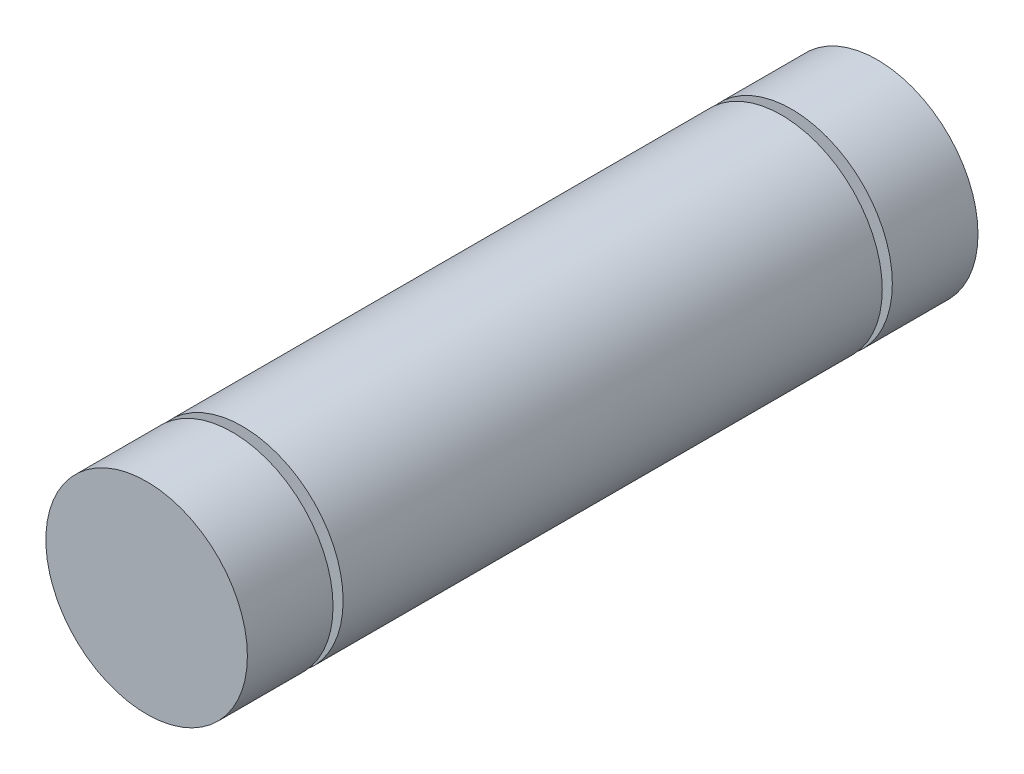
ISO-10303-21;
HEADER;
FILE_DESCRIPTION(('STEP AP214'),'2;1');
FILE_NAME('part.step','',(''),(''),'','','');
FILE_SCHEMA(('AUTOMOTIVE_DESIGN { 1 0 10303 214 1 1 1 1 }'));
ENDSEC;
DATA;
#1=APPLICATION_CONTEXT('core data for automotive mechanical design processes');
#2=APPLICATION_PROTOCOL_DEFINITION('international standard','automotive_design',2000,#1);
#3=PRODUCT_CONTEXT('',#1,'mechanical');
#4=PRODUCT('Part','Part','',(#3));
#5=PRODUCT_RELATED_PRODUCT_CATEGORY('part','',(#4));
#6=PRODUCT_DEFINITION_FORMATION('','',#4);
#7=PRODUCT_DEFINITION_CONTEXT('part definition',#1,'design');
#8=PRODUCT_DEFINITION('design','',#6,#7);
#9=PRODUCT_DEFINITION_SHAPE('','',#8);
#10=(LENGTH_UNIT() NAMED_UNIT(*) SI_UNIT(.MILLI.,.METRE.));
#11=(NAMED_UNIT(*) PLANE_ANGLE_UNIT() SI_UNIT($,.RADIAN.));
#12=(NAMED_UNIT(*) SI_UNIT($,.STERADIAN.) SOLID_ANGLE_UNIT());
#13=UNCERTAINTY_MEASURE_WITH_UNIT(LENGTH_MEASURE(1.E-05),#10,'distance_accuracy_value','');
#14=(GEOMETRIC_REPRESENTATION_CONTEXT(3) GLOBAL_UNCERTAINTY_ASSIGNED_CONTEXT((#13)) GLOBAL_UNIT_ASSIGNED_CONTEXT((#10,
#11,#12)) REPRESENTATION_CONTEXT('',''));
#15=CARTESIAN_POINT('',(0.,0.,0.));
#16=DIRECTION('',(0.,0.,1.));
#17=DIRECTION('',(1.,0.,0.));
#18=AXIS2_PLACEMENT_3D('',#15,#16,#17);
#19=CARTESIAN_POINT('',(0.,0.,145.));
#20=DIRECTION('',(0.,0.,-1.));
#21=DIRECTION('',(-1.,0.,0.));
#22=AXIS2_PLACEMENT_3D('',#19,#20,#21);
#23=CYLINDRICAL_SURFACE('',#22,20.);
#24=CARTESIAN_POINT('',(0.,0.,17.));
#25=DIRECTION('',(0.,0.,1.));
#26=DIRECTION('',(1.,0.,0.));
#27=AXIS2_PLACEMENT_3D('',#24,#25,#26);
#28=CIRCLE('',#27,20.);
#29=CARTESIAN_POINT('',(20.,0.,17.));
#30=VERTEX_POINT('',#29);
#31=EDGE_CURVE('E42',#30,#30,#28,.T.);
#32=ORIENTED_EDGE('',*,*,#31,.F.);
#33=EDGE_LOOP('',(#32));
#34=FACE_BOUND('',#33,.T.);
#35=CARTESIAN_POINT('',(0.,0.,0.));
#36=DIRECTION('',(0.,0.,1.));
#37=DIRECTION('',(1.,0.,0.));
#38=AXIS2_PLACEMENT_3D('',#35,#36,#37);
#39=CIRCLE('',#38,20.);
#40=CARTESIAN_POINT('',(20.,0.,0.));
#41=VERTEX_POINT('',#40);
#42=EDGE_CURVE('E35',#41,#41,#39,.T.);
#43=ORIENTED_EDGE('',*,*,#42,.T.);
#44=EDGE_LOOP('',(#43));
#45=FACE_BOUND('',#44,.T.);
#46=ADVANCED_FACE('F31',(#34,#45),#23,.T.);
#47=CARTESIAN_POINT('',(0.,0.,0.));
#48=DIRECTION('',(0.,0.,1.));
#49=DIRECTION('',(1.,0.,0.));
#50=AXIS2_PLACEMENT_3D('',#47,#48,#49);
#51=PLANE('',#50);
#52=ORIENTED_EDGE('',*,*,#42,.F.);
#53=EDGE_LOOP('',(#52));
#54=FACE_BOUND('',#53,.T.);
#55=ADVANCED_FACE('F91',(#54),#51,.F.);
#56=CARTESIAN_POINT('',(20.,0.,17.));
#57=DIRECTION('',(0.,0.,-1.));
#58=DIRECTION('',(-1.,0.,0.));
#59=AXIS2_PLACEMENT_3D('',#56,#57,#58);
#60=PLANE('',#59);
#61=CARTESIAN_POINT('',(0.,0.,17.));
#62=DIRECTION('',(0.,0.,1.));
#63=DIRECTION('',(1.,0.,0.));
#64=AXIS2_PLACEMENT_3D('',#61,#62,#63);
#65=CIRCLE('',#64,17.);
#66=CARTESIAN_POINT('',(17.,0.,17.));
#67=VERTEX_POINT('',#66);
#68=EDGE_CURVE('E46',#67,#67,#65,.T.);
#69=ORIENTED_EDGE('',*,*,#68,.F.);
#70=EDGE_LOOP('',(#69));
#71=FACE_BOUND('',#70,.T.);
#72=ORIENTED_EDGE('',*,*,#31,.T.);
#73=EDGE_LOOP('',(#72));
#74=FACE_BOUND('',#73,.T.);
#75=ADVANCED_FACE('F85',(#71,#74),#60,.F.);
#76=CARTESIAN_POINT('',(0.,0.,144.187962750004));
#77=DIRECTION('',(0.,0.,1.));
#78=DIRECTION('',(1.,0.,0.));
#79=AXIS2_PLACEMENT_3D('',#76,#77,#78);
#80=CYLINDRICAL_SURFACE('',#79,17.);
#81=CARTESIAN_POINT('',(0.,0.,19.));
#82=DIRECTION('',(0.,0.,1.));
#83=DIRECTION('',(1.,0.,0.));
#84=AXIS2_PLACEMENT_3D('',#81,#82,#83);
#85=CIRCLE('',#84,17.);
#86=CARTESIAN_POINT('',(17.,0.,19.));
#87=VERTEX_POINT('',#86);
#88=EDGE_CURVE('E49',#87,#87,#85,.T.);
#89=ORIENTED_EDGE('',*,*,#88,.F.);
#90=EDGE_LOOP('',(#89));
#91=FACE_BOUND('',#90,.T.);
#92=ORIENTED_EDGE('',*,*,#68,.T.);
#93=EDGE_LOOP('',(#92));
#94=FACE_BOUND('',#93,.T.);
#95=ADVANCED_FACE('F79',(#91,#94),#80,.T.);
#96=CARTESIAN_POINT('',(20.,0.,19.));
#97=DIRECTION('',(0.,0.,1.));
#98=DIRECTION('',(1.,0.,0.));
#99=AXIS2_PLACEMENT_3D('',#96,#97,#98);
#100=PLANE('',#99);
#101=CARTESIAN_POINT('',(0.,0.,19.));
#102=DIRECTION('',(0.,0.,1.));
#103=DIRECTION('',(1.,0.,0.));
#104=AXIS2_PLACEMENT_3D('',#101,#102,#103);
#105=CIRCLE('',#104,20.);
#106=CARTESIAN_POINT('',(20.,0.,19.));
#107=VERTEX_POINT('',#106);
#108=EDGE_CURVE('E52',#107,#107,#105,.T.);
#109=ORIENTED_EDGE('',*,*,#108,.F.);
#110=EDGE_LOOP('',(#109));
#111=FACE_BOUND('',#110,.T.);
#112=ORIENTED_EDGE('',*,*,#88,.T.);
#113=EDGE_LOOP('',(#112));
#114=FACE_BOUND('',#113,.T.);
#115=ADVANCED_FACE('F73',(#111,#114),#100,.F.);
#116=CARTESIAN_POINT('',(0.,0.,126.));
#117=DIRECTION('',(0.,0.,1.));
#118=DIRECTION('',(1.,0.,0.));
#119=AXIS2_PLACEMENT_3D('',#116,#117,#118);
#120=CIRCLE('',#119,20.);
#121=CARTESIAN_POINT('',(20.,0.,126.));
#122=VERTEX_POINT('',#121);
#123=EDGE_CURVE('E64',#122,#122,#120,.T.);
#124=ORIENTED_EDGE('',*,*,#123,.F.);
#125=EDGE_LOOP('',(#124));
#126=FACE_BOUND('',#125,.T.);
#127=ORIENTED_EDGE('',*,*,#108,.T.);
#128=EDGE_LOOP('',(#127));
#129=FACE_BOUND('',#128,.T.);
#130=ADVANCED_FACE('F33',(#126,#129),#23,.T.);
#131=CARTESIAN_POINT('',(20.,0.,128.));
#132=DIRECTION('',(0.,0.,1.));
#133=DIRECTION('',(1.,0.,0.));
#134=AXIS2_PLACEMENT_3D('',#131,#132,#133);
#135=PLANE('',#134);
#136=CARTESIAN_POINT('',(0.,0.,128.));
#137=DIRECTION('',(0.,0.,1.));
#138=DIRECTION('',(1.,0.,0.));
#139=AXIS2_PLACEMENT_3D('',#136,#137,#138);
#140=CIRCLE('',#139,20.);
#141=CARTESIAN_POINT('',(20.,0.,128.));
#142=VERTEX_POINT('',#141);
#143=EDGE_CURVE('E55',#142,#142,#140,.T.);
#144=ORIENTED_EDGE('',*,*,#143,.F.);
#145=EDGE_LOOP('',(#144));
#146=FACE_BOUND('',#145,.T.);
#147=CARTESIAN_POINT('',(0.,0.,128.));
#148=DIRECTION('',(0.,0.,1.));
#149=DIRECTION('',(1.,0.,0.));
#150=AXIS2_PLACEMENT_3D('',#147,#148,#149);
#151=CIRCLE('',#150,17.);
#152=CARTESIAN_POINT('',(17.,0.,128.));
#153=VERTEX_POINT('',#152);
#154=EDGE_CURVE('E58',#153,#153,#151,.T.);
#155=ORIENTED_EDGE('',*,*,#154,.T.);
#156=EDGE_LOOP('',(#155));
#157=FACE_BOUND('',#156,.T.);
#158=ADVANCED_FACE('F72',(#146,#157),#135,.F.);
#159=CARTESIAN_POINT('',(0.,0.,144.187962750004));
#160=DIRECTION('',(0.,0.,1.));
#161=DIRECTION('',(1.,0.,0.));
#162=AXIS2_PLACEMENT_3D('',#159,#160,#161);
#163=CYLINDRICAL_SURFACE('',#162,17.);
#164=ORIENTED_EDGE('',*,*,#154,.F.);
#165=EDGE_LOOP('',(#164));
#166=FACE_BOUND('',#165,.T.);
#167=CARTESIAN_POINT('',(0.,0.,126.));
#168=DIRECTION('',(0.,0.,1.));
#169=DIRECTION('',(1.,0.,0.));
#170=AXIS2_PLACEMENT_3D('',#167,#168,#169);
#171=CIRCLE('',#170,17.);
#172=CARTESIAN_POINT('',(17.,0.,126.));
#173=VERTEX_POINT('',#172);
#174=EDGE_CURVE('E61',#173,#173,#171,.T.);
#175=ORIENTED_EDGE('',*,*,#174,.T.);
#176=EDGE_LOOP('',(#175));
#177=FACE_BOUND('',#176,.T.);
#178=ADVANCED_FACE('F108',(#166,#177),#163,.T.);
#179=CARTESIAN_POINT('',(20.,0.,126.));
#180=DIRECTION('',(0.,0.,-1.));
#181=DIRECTION('',(-1.,0.,0.));
#182=AXIS2_PLACEMENT_3D('',#179,#180,#181);
#183=PLANE('',#182);
#184=ORIENTED_EDGE('',*,*,#174,.F.);
#185=EDGE_LOOP('',(#184));
#186=FACE_BOUND('',#185,.T.);
#187=ORIENTED_EDGE('',*,*,#123,.T.);
#188=EDGE_LOOP('',(#187));
#189=FACE_BOUND('',#188,.T.);
#190=ADVANCED_FACE('F68',(#186,#189),#183,.F.);
#191=CARTESIAN_POINT('',(0.,0.,145.));
#192=DIRECTION('',(0.,0.,1.));
#193=DIRECTION('',(1.,0.,0.));
#194=AXIS2_PLACEMENT_3D('',#191,#192,#193);
#195=PLANE('',#194);
#196=CARTESIAN_POINT('',(0.,0.,145.));
#197=DIRECTION('',(0.,0.,1.));
#198=DIRECTION('',(1.,0.,0.));
#199=AXIS2_PLACEMENT_3D('',#196,#197,#198);
#200=CIRCLE('',#199,20.);
#201=CARTESIAN_POINT('',(20.,0.,145.));
#202=VERTEX_POINT('',#201);
#203=EDGE_CURVE('E10',#202,#202,#200,.T.);
#204=ORIENTED_EDGE('',*,*,#203,.T.);
#205=EDGE_LOOP('',(#204));
#206=FACE_BOUND('',#205,.T.);
#207=ADVANCED_FACE('F103',(#206),#195,.T.);
#208=ORIENTED_EDGE('',*,*,#143,.T.);
#209=EDGE_LOOP('',(#208));
#210=FACE_BOUND('',#209,.T.);
#211=ORIENTED_EDGE('',*,*,#203,.F.);
#212=EDGE_LOOP('',(#211));
#213=FACE_BOUND('',#212,.T.);
#214=ADVANCED_FACE('F74',(#210,#213),#23,.T.);
#215=CLOSED_SHELL('',(#46,#55,#75,#95,#115,#130,#158,#178,#190,#207,#214));
#216=MANIFOLD_SOLID_BREP('B2',#215);
#217=ADVANCED_BREP_SHAPE_REPRESENTATION('',(#18,#216),#14);
#218=SHAPE_DEFINITION_REPRESENTATION(#9,#217);
ENDSEC;
END-ISO-10303-21;
